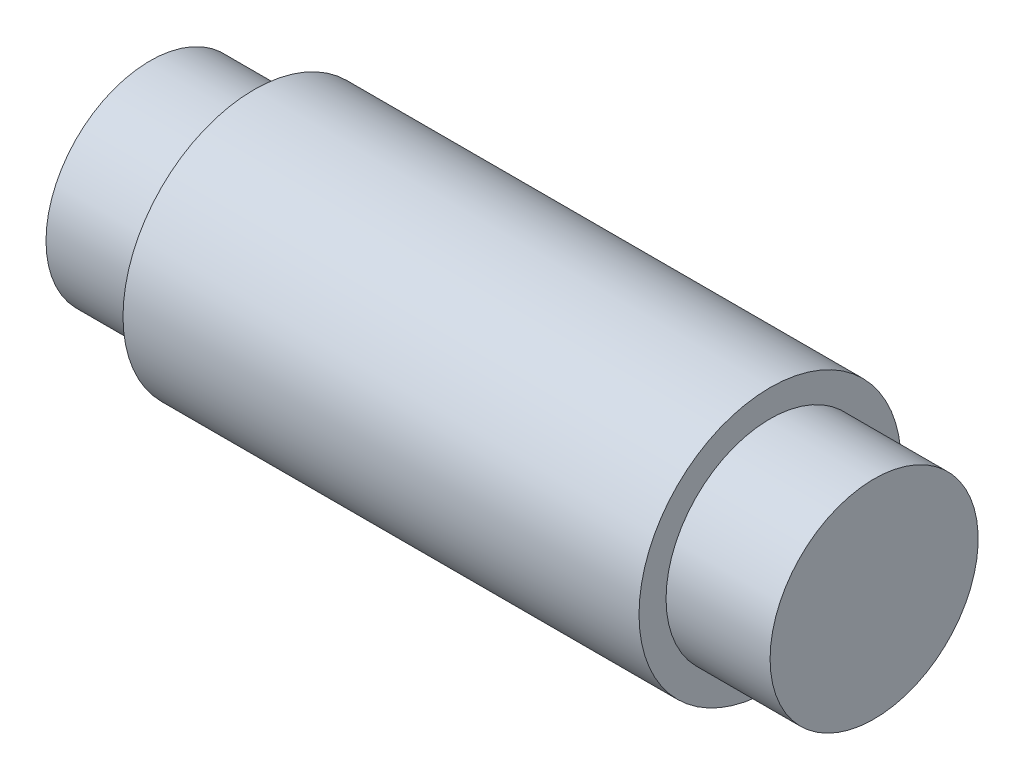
ISO-10303-21;
HEADER;
FILE_DESCRIPTION(('STEP AP214'),'2;1');
FILE_NAME('part.step','',(''),(''),'','','');
FILE_SCHEMA(('AUTOMOTIVE_DESIGN { 1 0 10303 214 1 1 1 1 }'));
ENDSEC;
DATA;
#1=APPLICATION_CONTEXT('core data for automotive mechanical design processes');
#2=APPLICATION_PROTOCOL_DEFINITION('international standard','automotive_design',2000,#1);
#3=PRODUCT_CONTEXT('',#1,'mechanical');
#4=PRODUCT('Part','Part','',(#3));
#5=PRODUCT_RELATED_PRODUCT_CATEGORY('part','',(#4));
#6=PRODUCT_DEFINITION_FORMATION('','',#4);
#7=PRODUCT_DEFINITION_CONTEXT('part definition',#1,'design');
#8=PRODUCT_DEFINITION('design','',#6,#7);
#9=PRODUCT_DEFINITION_SHAPE('','',#8);
#10=(LENGTH_UNIT() NAMED_UNIT(*) SI_UNIT(.MILLI.,.METRE.));
#11=(NAMED_UNIT(*) PLANE_ANGLE_UNIT() SI_UNIT($,.RADIAN.));
#12=(NAMED_UNIT(*) SI_UNIT($,.STERADIAN.) SOLID_ANGLE_UNIT());
#13=UNCERTAINTY_MEASURE_WITH_UNIT(LENGTH_MEASURE(1.E-05),#10,'distance_accuracy_value','');
#14=(GEOMETRIC_REPRESENTATION_CONTEXT(3) GLOBAL_UNCERTAINTY_ASSIGNED_CONTEXT((#13)) GLOBAL_UNIT_ASSIGNED_CONTEXT((#10,
#11,#12)) REPRESENTATION_CONTEXT('',''));
#15=CARTESIAN_POINT('',(0.,0.,0.));
#16=DIRECTION('',(0.,0.,1.));
#17=DIRECTION('',(1.,0.,0.));
#18=AXIS2_PLACEMENT_3D('',#15,#16,#17);
#19=CARTESIAN_POINT('',(-11.049,0.,0.));
#20=DIRECTION('',(1.,0.,0.));
#21=DIRECTION('',(0.,0.,-1.));
#22=AXIS2_PLACEMENT_3D('',#19,#20,#21);
#23=PLANE('',#22);
#24=CARTESIAN_POINT('',(-11.049,0.,0.));
#25=DIRECTION('',(-1.,0.,0.));
#26=DIRECTION('',(0.,0.,1.));
#27=AXIS2_PLACEMENT_3D('',#24,#25,#26);
#28=CIRCLE('',#27,3.175);
#29=CARTESIAN_POINT('',(-11.049,0.,3.175));
#30=VERTEX_POINT('',#29);
#31=EDGE_CURVE('E10',#30,#30,#28,.T.);
#32=ORIENTED_EDGE('',*,*,#31,.T.);
#33=EDGE_LOOP('',(#32));
#34=FACE_BOUND('',#33,.T.);
#35=ADVANCED_FACE('F30',(#34),#23,.F.);
#36=CARTESIAN_POINT('',(11.049,0.,0.));
#37=DIRECTION('',(-1.,0.,0.));
#38=DIRECTION('',(0.,0.,1.));
#39=AXIS2_PLACEMENT_3D('',#36,#37,#38);
#40=CYLINDRICAL_SURFACE('',#39,3.175);
#41=ORIENTED_EDGE('',*,*,#31,.F.);
#42=EDGE_LOOP('',(#41));
#43=FACE_BOUND('',#42,.T.);
#44=CARTESIAN_POINT('',(-7.874,0.,0.));
#45=DIRECTION('',(-1.,0.,0.));
#46=DIRECTION('',(0.,0.,1.));
#47=AXIS2_PLACEMENT_3D('',#44,#45,#46);
#48=CIRCLE('',#47,3.175);
#49=CARTESIAN_POINT('',(-7.874,0.,3.175));
#50=VERTEX_POINT('',#49);
#51=EDGE_CURVE('E36',#50,#50,#48,.T.);
#52=ORIENTED_EDGE('',*,*,#51,.T.);
#53=EDGE_LOOP('',(#52));
#54=FACE_BOUND('',#53,.T.);
#55=ADVANCED_FACE('F68',(#43,#54),#40,.T.);
#56=CARTESIAN_POINT('',(-7.874,3.175,0.));
#57=DIRECTION('',(1.,0.,0.));
#58=DIRECTION('',(0.,0.,-1.));
#59=AXIS2_PLACEMENT_3D('',#56,#57,#58);
#60=PLANE('',#59);
#61=ORIENTED_EDGE('',*,*,#51,.F.);
#62=EDGE_LOOP('',(#61));
#63=FACE_BOUND('',#62,.T.);
#64=CARTESIAN_POINT('',(-7.874,0.,0.));
#65=DIRECTION('',(-1.,0.,0.));
#66=DIRECTION('',(0.,0.,1.));
#67=AXIS2_PLACEMENT_3D('',#64,#65,#66);
#68=CIRCLE('',#67,4.);
#69=CARTESIAN_POINT('',(-7.874,0.,4.));
#70=VERTEX_POINT('',#69);
#71=EDGE_CURVE('E40',#70,#70,#68,.T.);
#72=ORIENTED_EDGE('',*,*,#71,.T.);
#73=EDGE_LOOP('',(#72));
#74=FACE_BOUND('',#73,.T.);
#75=ADVANCED_FACE('F72',(#63,#74),#60,.F.);
#76=CARTESIAN_POINT('',(11.049,0.,0.));
#77=DIRECTION('',(-1.,0.,0.));
#78=DIRECTION('',(0.,0.,1.));
#79=AXIS2_PLACEMENT_3D('',#76,#77,#78);
#80=CYLINDRICAL_SURFACE('',#79,4.);
#81=ORIENTED_EDGE('',*,*,#71,.F.);
#82=EDGE_LOOP('',(#81));
#83=FACE_BOUND('',#82,.T.);
#84=CARTESIAN_POINT('',(7.874,0.,0.));
#85=DIRECTION('',(-1.,0.,0.));
#86=DIRECTION('',(0.,0.,1.));
#87=AXIS2_PLACEMENT_3D('',#84,#85,#86);
#88=CIRCLE('',#87,4.);
#89=CARTESIAN_POINT('',(7.874,0.,4.));
#90=VERTEX_POINT('',#89);
#91=EDGE_CURVE('E44',#90,#90,#88,.T.);
#92=ORIENTED_EDGE('',*,*,#91,.T.);
#93=EDGE_LOOP('',(#92));
#94=FACE_BOUND('',#93,.T.);
#95=ADVANCED_FACE('F77',(#83,#94),#80,.T.);
#96=CARTESIAN_POINT('',(7.874,3.175,0.));
#97=DIRECTION('',(-1.,0.,0.));
#98=DIRECTION('',(0.,0.,1.));
#99=AXIS2_PLACEMENT_3D('',#96,#97,#98);
#100=PLANE('',#99);
#101=ORIENTED_EDGE('',*,*,#91,.F.);
#102=EDGE_LOOP('',(#101));
#103=FACE_BOUND('',#102,.T.);
#104=CARTESIAN_POINT('',(7.874,0.,0.));
#105=DIRECTION('',(-1.,0.,0.));
#106=DIRECTION('',(0.,0.,1.));
#107=AXIS2_PLACEMENT_3D('',#104,#105,#106);
#108=CIRCLE('',#107,3.175);
#109=CARTESIAN_POINT('',(7.874,0.,3.175));
#110=VERTEX_POINT('',#109);
#111=EDGE_CURVE('E49',#110,#110,#108,.T.);
#112=ORIENTED_EDGE('',*,*,#111,.T.);
#113=EDGE_LOOP('',(#112));
#114=FACE_BOUND('',#113,.T.);
#115=ADVANCED_FACE('F64',(#103,#114),#100,.F.);
#116=CARTESIAN_POINT('',(11.049,0.,0.));
#117=DIRECTION('',(-1.,0.,0.));
#118=DIRECTION('',(0.,0.,1.));
#119=AXIS2_PLACEMENT_3D('',#116,#117,#118);
#120=CYLINDRICAL_SURFACE('',#119,3.175);
#121=ORIENTED_EDGE('',*,*,#111,.F.);
#122=EDGE_LOOP('',(#121));
#123=FACE_BOUND('',#122,.T.);
#124=CARTESIAN_POINT('',(11.049,0.,0.));
#125=DIRECTION('',(-1.,0.,0.));
#126=DIRECTION('',(0.,0.,1.));
#127=AXIS2_PLACEMENT_3D('',#124,#125,#126);
#128=CIRCLE('',#127,3.175);
#129=CARTESIAN_POINT('',(11.049,0.,3.175));
#130=VERTEX_POINT('',#129);
#131=EDGE_CURVE('E52',#130,#130,#128,.T.);
#132=ORIENTED_EDGE('',*,*,#131,.T.);
#133=EDGE_LOOP('',(#132));
#134=FACE_BOUND('',#133,.T.);
#135=ADVANCED_FACE('F56',(#123,#134),#120,.T.);
#136=CARTESIAN_POINT('',(11.049,0.,0.));
#137=DIRECTION('',(-1.,0.,0.));
#138=DIRECTION('',(0.,0.,1.));
#139=AXIS2_PLACEMENT_3D('',#136,#137,#138);
#140=PLANE('',#139);
#141=ORIENTED_EDGE('',*,*,#131,.F.);
#142=EDGE_LOOP('',(#141));
#143=FACE_BOUND('',#142,.T.);
#144=ADVANCED_FACE('F58',(#143),#140,.F.);
#145=CLOSED_SHELL('',(#35,#55,#75,#95,#115,#135,#144));
#146=MANIFOLD_SOLID_BREP('B2',#145);
#147=ADVANCED_BREP_SHAPE_REPRESENTATION('',(#18,#146),#14);
#148=SHAPE_DEFINITION_REPRESENTATION(#9,#147);
ENDSEC;
END-ISO-10303-21;
